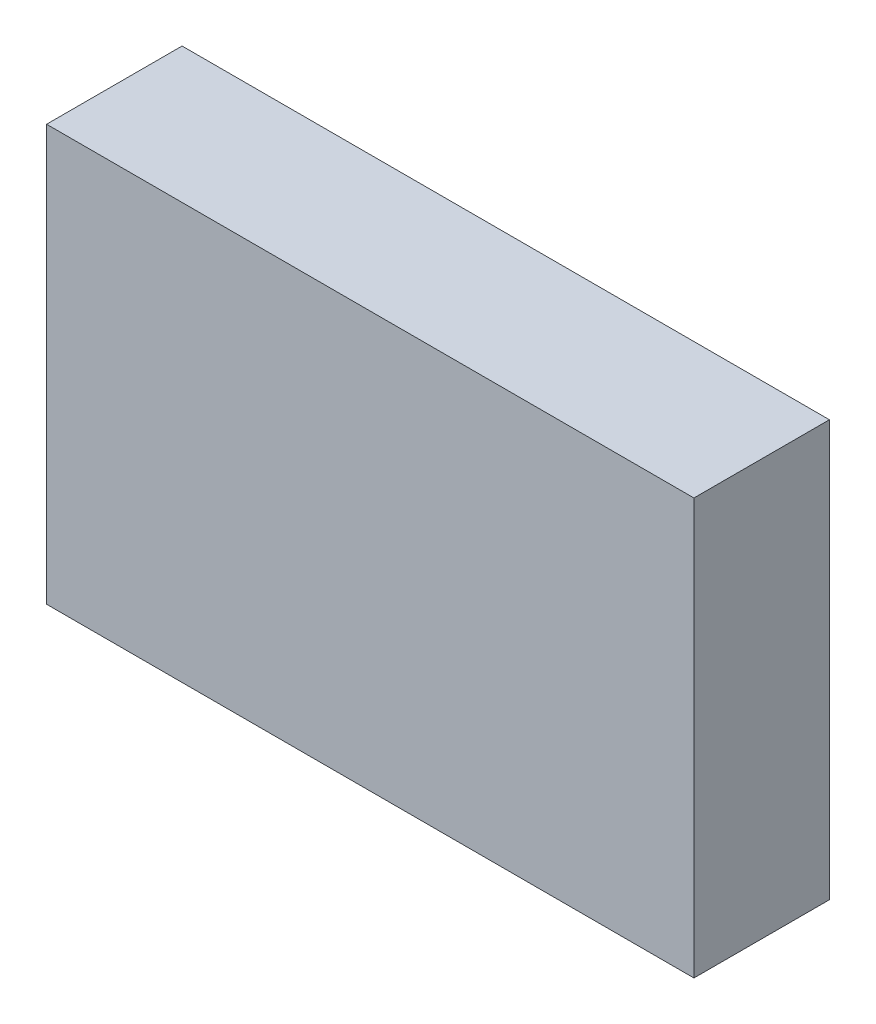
from build123d import *

# Parameters (mm, degrees)
SKETCH1_W           = 47.778292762
SKETCH1_H           = 30.683307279
BOSS_EXTRUDE1_DEPTH = 10


with BuildPart() as part:
    # Sketch1 → Boss-Extrude1 (new body)
    with BuildSketch(Plane.XY):
        with Locations((0, -0.876665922)):
            Rectangle(SKETCH1_W, SKETCH1_H)
    extrude(amount=BOSS_EXTRUDE1_DEPTH)


solid = part.part
